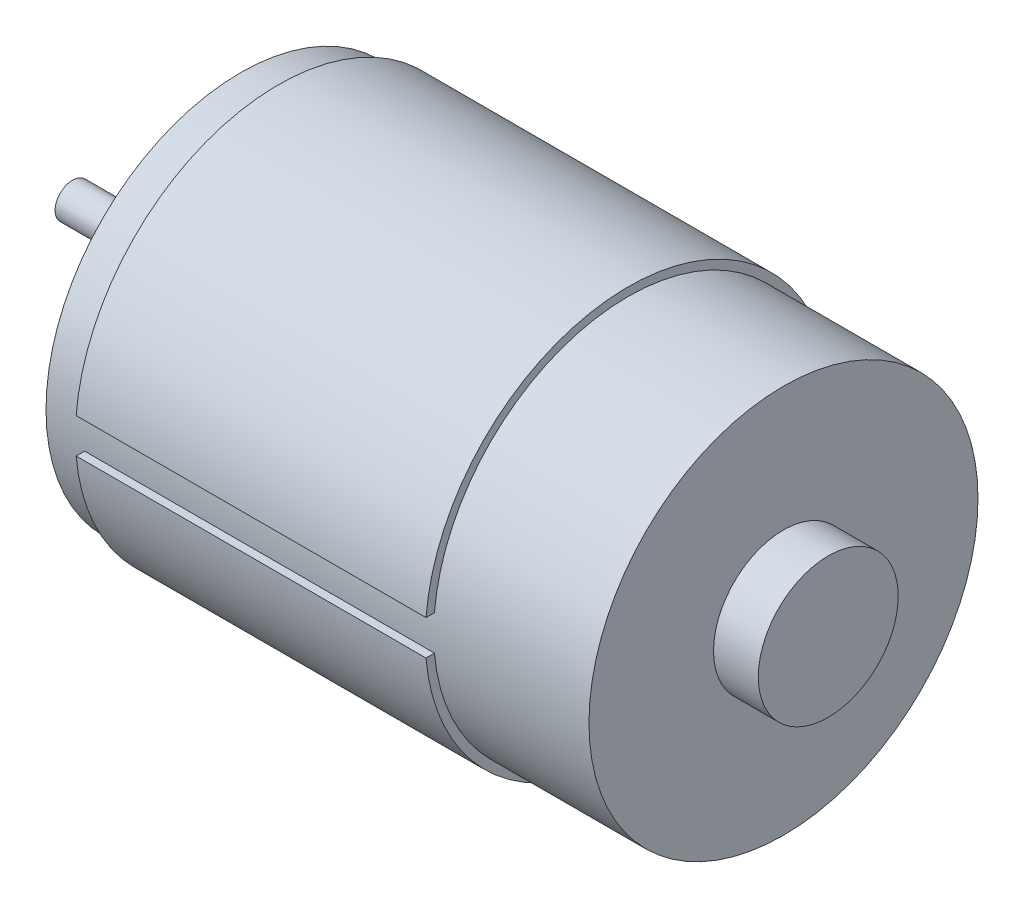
ISO-10303-21;
HEADER;
FILE_DESCRIPTION(('STEP AP214'),'2;1');
FILE_NAME('part.step','',(''),(''),'','','');
FILE_SCHEMA(('AUTOMOTIVE_DESIGN { 1 0 10303 214 1 1 1 1 }'));
ENDSEC;
DATA;
#1=APPLICATION_CONTEXT('core data for automotive mechanical design processes');
#2=APPLICATION_PROTOCOL_DEFINITION('international standard','automotive_design',2000,#1);
#3=PRODUCT_CONTEXT('',#1,'mechanical');
#4=PRODUCT('Part','Part','',(#3));
#5=PRODUCT_RELATED_PRODUCT_CATEGORY('part','',(#4));
#6=PRODUCT_DEFINITION_FORMATION('','',#4);
#7=PRODUCT_DEFINITION_CONTEXT('part definition',#1,'design');
#8=PRODUCT_DEFINITION('design','',#6,#7);
#9=PRODUCT_DEFINITION_SHAPE('','',#8);
#10=(LENGTH_UNIT() NAMED_UNIT(*) SI_UNIT(.MILLI.,.METRE.));
#11=(NAMED_UNIT(*) PLANE_ANGLE_UNIT() SI_UNIT($,.RADIAN.));
#12=(NAMED_UNIT(*) SI_UNIT($,.STERADIAN.) SOLID_ANGLE_UNIT());
#13=UNCERTAINTY_MEASURE_WITH_UNIT(LENGTH_MEASURE(1.E-05),#10,'distance_accuracy_value','');
#14=(GEOMETRIC_REPRESENTATION_CONTEXT(3) GLOBAL_UNCERTAINTY_ASSIGNED_CONTEXT((#13)) GLOBAL_UNIT_ASSIGNED_CONTEXT((#10,
#11,#12)) REPRESENTATION_CONTEXT('',''));
#15=CARTESIAN_POINT('',(0.,0.,0.));
#16=DIRECTION('',(0.,0.,1.));
#17=DIRECTION('',(1.,0.,0.));
#18=AXIS2_PLACEMENT_3D('',#15,#16,#17);
#19=CARTESIAN_POINT('',(14.7,13.9,0.));
#20=DIRECTION('',(1.,0.,0.));
#21=DIRECTION('',(0.,0.,-1.));
#22=AXIS2_PLACEMENT_3D('',#19,#20,#21);
#23=PLANE('',#22);
#24=DIRECTION('',(0.,0.,-1.));
#25=VECTOR('',#24,1.);
#26=CARTESIAN_POINT('',(14.7,1.25,0.));
#27=LINE('',#26,#25);
#28=CARTESIAN_POINT('',(14.7,1.25,14.4460202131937));
#29=VERTEX_POINT('',#28);
#30=CARTESIAN_POINT('',(14.7,1.25,13.8436808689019));
#31=VERTEX_POINT('',#30);
#32=EDGE_CURVE('E260',#29,#31,#27,.T.);
#33=ORIENTED_EDGE('',*,*,#32,.F.);
#34=CARTESIAN_POINT('',(14.7,0.,0.));
#35=DIRECTION('',(-1.,0.,0.));
#36=DIRECTION('',(0.,0.,1.));
#37=AXIS2_PLACEMENT_3D('',#34,#35,#36);
#38=CIRCLE('',#37,14.5);
#39=CARTESIAN_POINT('',(14.7,-1.25,14.4460202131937));
#40=VERTEX_POINT('',#39);
#41=EDGE_CURVE('E102',#29,#40,#38,.T.);
#42=ORIENTED_EDGE('',*,*,#41,.T.);
#43=DIRECTION('',(0.,0.,1.));
#44=VECTOR('',#43,1.);
#45=CARTESIAN_POINT('',(14.7,-1.25,0.));
#46=LINE('',#45,#44);
#47=CARTESIAN_POINT('',(14.7,-1.25,13.8436808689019));
#48=VERTEX_POINT('',#47);
#49=EDGE_CURVE('E265',#48,#40,#46,.T.);
#50=ORIENTED_EDGE('',*,*,#49,.F.);
#51=CARTESIAN_POINT('',(14.7,0.,0.));
#52=DIRECTION('',(-1.,0.,0.));
#53=DIRECTION('',(0.,0.,1.));
#54=AXIS2_PLACEMENT_3D('',#51,#52,#53);
#55=CIRCLE('',#54,13.9);
#56=EDGE_CURVE('E94',#31,#48,#55,.T.);
#57=ORIENTED_EDGE('',*,*,#56,.F.);
#58=EDGE_LOOP('',(#33,#42,#50,#57));
#59=FACE_BOUND('',#58,.T.);
#60=ADVANCED_FACE('F37',(#59),#23,.F.);
#61=CARTESIAN_POINT('',(-8.12080536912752,0.,0.));
#62=DIRECTION('',(-1.,0.,0.));
#63=DIRECTION('',(0.,0.,1.));
#64=AXIS2_PLACEMENT_3D('',#61,#62,#63);
#65=CYLINDRICAL_SURFACE('',#64,14.5);
#66=DIRECTION('',(-1.,0.,0.));
#67=VECTOR('',#66,1.);
#68=CARTESIAN_POINT('',(-8.12080536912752,1.25,14.4460202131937));
#69=LINE('',#68,#67);
#70=CARTESIAN_POINT('',(39.7,1.25,14.4460202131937));
#71=VERTEX_POINT('',#70);
#72=EDGE_CURVE('E60',#71,#29,#69,.T.);
#73=ORIENTED_EDGE('',*,*,#72,.F.);
#74=CARTESIAN_POINT('',(39.7,0.,0.));
#75=DIRECTION('',(-1.,0.,0.));
#76=DIRECTION('',(0.,0.,1.));
#77=AXIS2_PLACEMENT_3D('',#74,#75,#76);
#78=CIRCLE('',#77,14.5);
#79=CARTESIAN_POINT('',(39.7,-1.25,14.4460202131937));
#80=VERTEX_POINT('',#79);
#81=EDGE_CURVE('E99',#71,#80,#78,.T.);
#82=ORIENTED_EDGE('',*,*,#81,.T.);
#83=DIRECTION('',(-1.,0.,0.));
#84=VECTOR('',#83,1.);
#85=CARTESIAN_POINT('',(-8.12080536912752,-1.25,14.4460202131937));
#86=LINE('',#85,#84);
#87=EDGE_CURVE('E52',#40,#80,#86,.F.);
#88=ORIENTED_EDGE('',*,*,#87,.F.);
#89=ORIENTED_EDGE('',*,*,#41,.F.);
#90=EDGE_LOOP('',(#73,#82,#88,#89));
#91=FACE_BOUND('',#90,.T.);
#92=ADVANCED_FACE('F154',(#91),#65,.T.);
#93=CARTESIAN_POINT('',(39.7,14.5,0.));
#94=DIRECTION('',(-1.,0.,0.));
#95=DIRECTION('',(0.,0.,1.));
#96=AXIS2_PLACEMENT_3D('',#93,#94,#95);
#97=PLANE('',#96);
#98=DIRECTION('',(0.,0.,1.));
#99=VECTOR('',#98,1.);
#100=CARTESIAN_POINT('',(39.7,1.25,0.));
#101=LINE('',#100,#99);
#102=CARTESIAN_POINT('',(39.7,1.25,13.8436808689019));
#103=VERTEX_POINT('',#102);
#104=EDGE_CURVE('E98',#103,#71,#101,.T.);
#105=ORIENTED_EDGE('',*,*,#104,.F.);
#106=CARTESIAN_POINT('',(39.7,0.,0.));
#107=DIRECTION('',(-1.,0.,0.));
#108=DIRECTION('',(0.,0.,1.));
#109=AXIS2_PLACEMENT_3D('',#106,#107,#108);
#110=CIRCLE('',#109,13.9);
#111=CARTESIAN_POINT('',(39.7,-1.25,13.8436808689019));
#112=VERTEX_POINT('',#111);
#113=EDGE_CURVE('E92',#103,#112,#110,.T.);
#114=ORIENTED_EDGE('',*,*,#113,.T.);
#115=DIRECTION('',(0.,0.,-1.));
#116=VECTOR('',#115,1.);
#117=CARTESIAN_POINT('',(39.7,-1.25,0.));
#118=LINE('',#117,#116);
#119=EDGE_CURVE('E75',#80,#112,#118,.T.);
#120=ORIENTED_EDGE('',*,*,#119,.F.);
#121=ORIENTED_EDGE('',*,*,#81,.F.);
#122=EDGE_LOOP('',(#105,#114,#120,#121));
#123=FACE_BOUND('',#122,.T.);
#124=ADVANCED_FACE('F97',(#123),#97,.F.);
#125=CARTESIAN_POINT('',(0.,0.,0.));
#126=DIRECTION('',(1.,0.,0.));
#127=DIRECTION('',(0.,0.,-1.));
#128=AXIS2_PLACEMENT_3D('',#125,#126,#127);
#129=PLANE('',#128);
#130=CARTESIAN_POINT('',(0.,0.,0.));
#131=DIRECTION('',(-1.,0.,0.));
#132=DIRECTION('',(0.,0.,1.));
#133=AXIS2_PLACEMENT_3D('',#130,#131,#132);
#134=CIRCLE('',#133,1.25);
#135=CARTESIAN_POINT('',(0.,0.,1.25));
#136=VERTEX_POINT('',#135);
#137=EDGE_CURVE('E11',#136,#136,#134,.T.);
#138=ORIENTED_EDGE('',*,*,#137,.T.);
#139=EDGE_LOOP('',(#138));
#140=FACE_BOUND('',#139,.T.);
#141=ADVANCED_FACE('F39',(#140),#129,.F.);
#142=CARTESIAN_POINT('',(-8.12080536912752,0.,0.));
#143=DIRECTION('',(-1.,0.,0.));
#144=DIRECTION('',(0.,0.,1.));
#145=AXIS2_PLACEMENT_3D('',#142,#143,#144);
#146=CYLINDRICAL_SURFACE('',#145,1.25);
#147=ORIENTED_EDGE('',*,*,#137,.F.);
#148=EDGE_LOOP('',(#147));
#149=FACE_BOUND('',#148,.T.);
#150=CARTESIAN_POINT('',(9.3,0.,0.));
#151=DIRECTION('',(-1.,0.,0.));
#152=DIRECTION('',(0.,0.,1.));
#153=AXIS2_PLACEMENT_3D('',#150,#151,#152);
#154=CIRCLE('',#153,1.25);
#155=CARTESIAN_POINT('',(9.3,0.,1.25));
#156=VERTEX_POINT('',#155);
#157=EDGE_CURVE('E45',#156,#156,#154,.T.);
#158=ORIENTED_EDGE('',*,*,#157,.T.);
#159=EDGE_LOOP('',(#158));
#160=FACE_BOUND('',#159,.T.);
#161=ADVANCED_FACE('F123',(#149,#160),#146,.T.);
#162=CARTESIAN_POINT('',(9.3,1.25,0.));
#163=DIRECTION('',(1.,0.,0.));
#164=DIRECTION('',(0.,0.,-1.));
#165=AXIS2_PLACEMENT_3D('',#162,#163,#164);
#166=PLANE('',#165);
#167=ORIENTED_EDGE('',*,*,#157,.F.);
#168=EDGE_LOOP('',(#167));
#169=FACE_BOUND('',#168,.T.);
#170=CARTESIAN_POINT('',(9.3,0.,0.));
#171=DIRECTION('',(-1.,0.,0.));
#172=DIRECTION('',(0.,0.,1.));
#173=AXIS2_PLACEMENT_3D('',#170,#171,#172);
#174=CIRCLE('',#173,5.);
#175=CARTESIAN_POINT('',(9.3,0.,5.));
#176=VERTEX_POINT('',#175);
#177=EDGE_CURVE('E118',#176,#176,#174,.T.);
#178=ORIENTED_EDGE('',*,*,#177,.T.);
#179=EDGE_LOOP('',(#178));
#180=FACE_BOUND('',#179,.T.);
#181=ADVANCED_FACE('F125',(#169,#180),#166,.F.);
#182=CARTESIAN_POINT('',(-8.12080536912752,0.,0.));
#183=DIRECTION('',(-1.,0.,0.));
#184=DIRECTION('',(0.,0.,1.));
#185=AXIS2_PLACEMENT_3D('',#182,#183,#184);
#186=CYLINDRICAL_SURFACE('',#185,5.);
#187=ORIENTED_EDGE('',*,*,#177,.F.);
#188=EDGE_LOOP('',(#187));
#189=FACE_BOUND('',#188,.T.);
#190=CARTESIAN_POINT('',(12.,0.,0.));
#191=DIRECTION('',(-1.,0.,0.));
#192=DIRECTION('',(0.,0.,1.));
#193=AXIS2_PLACEMENT_3D('',#190,#191,#192);
#194=CIRCLE('',#193,5.);
#195=CARTESIAN_POINT('',(12.,0.,5.));
#196=VERTEX_POINT('',#195);
#197=EDGE_CURVE('E115',#196,#196,#194,.T.);
#198=ORIENTED_EDGE('',*,*,#197,.T.);
#199=EDGE_LOOP('',(#198));
#200=FACE_BOUND('',#199,.T.);
#201=ADVANCED_FACE('F128',(#189,#200),#186,.T.);
#202=CARTESIAN_POINT('',(12.,5.,0.));
#203=DIRECTION('',(1.,0.,0.));
#204=DIRECTION('',(0.,0.,-1.));
#205=AXIS2_PLACEMENT_3D('',#202,#203,#204);
#206=PLANE('',#205);
#207=ORIENTED_EDGE('',*,*,#197,.F.);
#208=EDGE_LOOP('',(#207));
#209=FACE_BOUND('',#208,.T.);
#210=CARTESIAN_POINT('',(12.,0.,0.));
#211=DIRECTION('',(-1.,0.,0.));
#212=DIRECTION('',(0.,0.,1.));
#213=AXIS2_PLACEMENT_3D('',#210,#211,#212);
#214=CIRCLE('',#213,13.9);
#215=CARTESIAN_POINT('',(12.,0.,13.9));
#216=VERTEX_POINT('',#215);
#217=EDGE_CURVE('E112',#216,#216,#214,.T.);
#218=ORIENTED_EDGE('',*,*,#217,.T.);
#219=EDGE_LOOP('',(#218));
#220=FACE_BOUND('',#219,.T.);
#221=ADVANCED_FACE('F134',(#209,#220),#206,.F.);
#222=CARTESIAN_POINT('',(-8.12080536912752,0.,0.));
#223=DIRECTION('',(-1.,0.,0.));
#224=DIRECTION('',(0.,0.,1.));
#225=AXIS2_PLACEMENT_3D('',#222,#223,#224);
#226=CYLINDRICAL_SURFACE('',#225,13.9);
#227=ORIENTED_EDGE('',*,*,#217,.F.);
#228=EDGE_LOOP('',(#227));
#229=FACE_BOUND('',#228,.T.);
#230=ORIENTED_EDGE('',*,*,#113,.F.);
#231=DIRECTION('',(-1.,0.,0.));
#232=VECTOR('',#231,1.);
#233=CARTESIAN_POINT('',(54.,1.25,13.8436808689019));
#234=LINE('',#233,#232);
#235=EDGE_CURVE('E84',#103,#31,#234,.T.);
#236=ORIENTED_EDGE('',*,*,#235,.T.);
#237=ORIENTED_EDGE('',*,*,#56,.T.);
#238=DIRECTION('',(-1.,0.,0.));
#239=VECTOR('',#238,1.);
#240=CARTESIAN_POINT('',(54.,-1.25,13.8436808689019));
#241=LINE('',#240,#239);
#242=EDGE_CURVE('E78',#112,#48,#241,.T.);
#243=ORIENTED_EDGE('',*,*,#242,.F.);
#244=EDGE_LOOP('',(#230,#236,#237,#243));
#245=FACE_BOUND('',#244,.T.);
#246=CARTESIAN_POINT('',(50.8,0.,0.));
#247=DIRECTION('',(-1.,0.,0.));
#248=DIRECTION('',(0.,0.,1.));
#249=AXIS2_PLACEMENT_3D('',#246,#247,#248);
#250=CIRCLE('',#249,13.9);
#251=CARTESIAN_POINT('',(50.8,0.,13.9));
#252=VERTEX_POINT('',#251);
#253=EDGE_CURVE('E100',#252,#252,#250,.T.);
#254=ORIENTED_EDGE('',*,*,#253,.T.);
#255=EDGE_LOOP('',(#254));
#256=FACE_BOUND('',#255,.T.);
#257=ADVANCED_FACE('F89',(#229,#245,#256),#226,.T.);
#258=CARTESIAN_POINT('',(50.8,13.9,0.));
#259=DIRECTION('',(-1.,0.,0.));
#260=DIRECTION('',(0.,0.,1.));
#261=AXIS2_PLACEMENT_3D('',#258,#259,#260);
#262=PLANE('',#261);
#263=ORIENTED_EDGE('',*,*,#253,.F.);
#264=EDGE_LOOP('',(#263));
#265=FACE_BOUND('',#264,.T.);
#266=CARTESIAN_POINT('',(50.8,0.,0.));
#267=DIRECTION('',(-1.,0.,0.));
#268=DIRECTION('',(0.,0.,1.));
#269=AXIS2_PLACEMENT_3D('',#266,#267,#268);
#270=CIRCLE('',#269,5.);
#271=CARTESIAN_POINT('',(50.8,0.,5.));
#272=VERTEX_POINT('',#271);
#273=EDGE_CURVE('E105',#272,#272,#270,.T.);
#274=ORIENTED_EDGE('',*,*,#273,.T.);
#275=EDGE_LOOP('',(#274));
#276=FACE_BOUND('',#275,.T.);
#277=ADVANCED_FACE('F144',(#265,#276),#262,.F.);
#278=CARTESIAN_POINT('',(-8.12080536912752,0.,0.));
#279=DIRECTION('',(-1.,0.,0.));
#280=DIRECTION('',(0.,0.,1.));
#281=AXIS2_PLACEMENT_3D('',#278,#279,#280);
#282=CYLINDRICAL_SURFACE('',#281,5.);
#283=ORIENTED_EDGE('',*,*,#273,.F.);
#284=EDGE_LOOP('',(#283));
#285=FACE_BOUND('',#284,.T.);
#286=CARTESIAN_POINT('',(54.,0.,0.));
#287=DIRECTION('',(-1.,0.,0.));
#288=DIRECTION('',(0.,0.,1.));
#289=AXIS2_PLACEMENT_3D('',#286,#287,#288);
#290=CIRCLE('',#289,5.);
#291=CARTESIAN_POINT('',(54.,0.,5.));
#292=VERTEX_POINT('',#291);
#293=EDGE_CURVE('E262',#292,#292,#290,.T.);
#294=ORIENTED_EDGE('',*,*,#293,.T.);
#295=EDGE_LOOP('',(#294));
#296=FACE_BOUND('',#295,.T.);
#297=ADVANCED_FACE('F149',(#285,#296),#282,.T.);
#298=CARTESIAN_POINT('',(54.,5.,0.));
#299=DIRECTION('',(-1.,0.,0.));
#300=DIRECTION('',(0.,0.,1.));
#301=AXIS2_PLACEMENT_3D('',#298,#299,#300);
#302=PLANE('',#301);
#303=ORIENTED_EDGE('',*,*,#293,.F.);
#304=EDGE_LOOP('',(#303));
#305=FACE_BOUND('',#304,.T.);
#306=ADVANCED_FACE('F189',(#305),#302,.F.);
#307=CARTESIAN_POINT('',(54.,1.25,13.8436808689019));
#308=DIRECTION('',(0.,-1.,0.));
#309=DIRECTION('',(0.,0.,-1.));
#310=AXIS2_PLACEMENT_3D('',#307,#308,#309);
#311=PLANE('',#310);
#312=ORIENTED_EDGE('',*,*,#32,.T.);
#313=ORIENTED_EDGE('',*,*,#235,.F.);
#314=ORIENTED_EDGE('',*,*,#104,.T.);
#315=ORIENTED_EDGE('',*,*,#72,.T.);
#316=EDGE_LOOP('',(#312,#313,#314,#315));
#317=FACE_BOUND('',#316,.T.);
#318=ADVANCED_FACE('F194',(#317),#311,.T.);
#319=CARTESIAN_POINT('',(54.,-1.25,17.2145849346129));
#320=DIRECTION('',(0.,1.,0.));
#321=DIRECTION('',(0.,0.,1.));
#322=AXIS2_PLACEMENT_3D('',#319,#320,#321);
#323=PLANE('',#322);
#324=ORIENTED_EDGE('',*,*,#49,.T.);
#325=ORIENTED_EDGE('',*,*,#87,.T.);
#326=ORIENTED_EDGE('',*,*,#119,.T.);
#327=ORIENTED_EDGE('',*,*,#242,.T.);
#328=EDGE_LOOP('',(#324,#325,#326,#327));
#329=FACE_BOUND('',#328,.T.);
#330=ADVANCED_FACE('F77',(#329),#323,.T.);
#331=CLOSED_SHELL('',(#60,#92,#124,#141,#161,#181,#201,#221,#257,#277,#297,#306,#318,#330));
#332=MANIFOLD_SOLID_BREP('B2',#331);
#333=ADVANCED_BREP_SHAPE_REPRESENTATION('',(#18,#332),#14);
#334=SHAPE_DEFINITION_REPRESENTATION(#9,#333);
ENDSEC;
END-ISO-10303-21;
